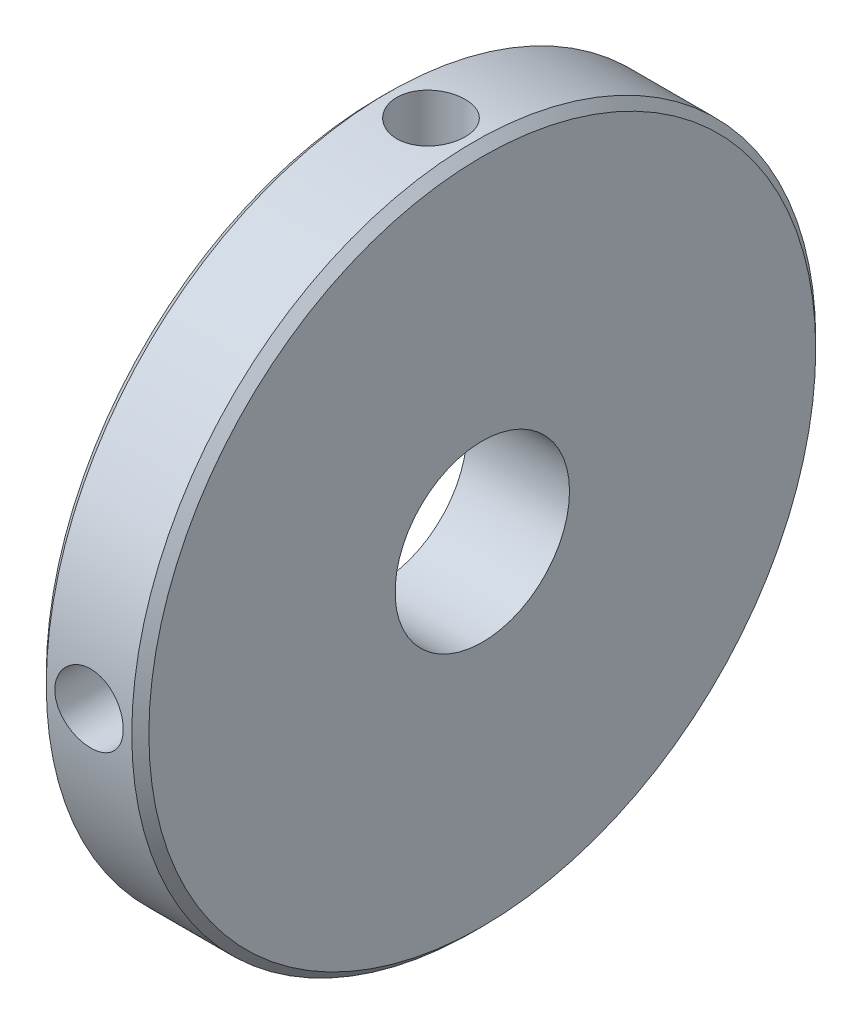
from build123d import *

# Parameters (mm, degrees)
ESQUISSE1_W                  = 6
ESQUISSE1_H                  = 20
CHANFREIN1_SIZE              = 0.5
R_P_TITION_CIRCULAIRE1_COUNT = 4
TROU_TARAUD_M12X1_752_D      = 10.2


with BuildPart() as part:
    # Esquisse1 → Base-R_volution (revolve)
    with BuildSketch(Plane.XY, mode=Mode.PRIVATE) as base_r_volution_sk:
        with Locations((3, 10)):
            Rectangle(ESQUISSE1_W, ESQUISSE1_H)
    revolve(base_r_volution_sk.sketch.rotate(Axis((-6.22145749, 0, 0), (1, 0, 0)), 90), axis=Axis((-6.22145749, 0, 0), (1, 0, 0)))

    # Chanfrein1
    chanfrein1_edges = [part.edges().sort_by_distance(p)[0] for p in [
        (6, 0, -20),
        (0, 0, -20),
    ]]
    chamfer(chanfrein1_edges, length=CHANFREIN1_SIZE)

    # Esquisse2 → Trou radial (revolve, cut)
    with BuildSketch(Plane.XY, mode=Mode.PRIVATE) as trou_radial_sk:
        Polygon((5, 20), (3, 20), (3, 13.798278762), (5, 15), align=None)
    trou_radial = revolve(trou_radial_sk.sketch.rotate(Axis((3, 20, 0), (0, -1, 0)), 180), axis=Axis((3, 20, 0), (0, -1, 0)), mode=Mode.SUBTRACT)

    # R_p_tition circulaire1: Trou radial ×4 about axis
    r_p_tition_circulaire1_axis = Axis((43.77854251, 0, 0), (-1, 0, 0))
    for i in range(1, R_P_TITION_CIRCULAIRE1_COUNT):
        add(trou_radial.rotate(r_p_tition_circulaire1_axis, i * 360 / R_P_TITION_CIRCULAIRE1_COUNT), mode=Mode.SUBTRACT)

    # Trou taraud_ M12x1.752 (through all)
    with Locations(Plane(origin=(6, 0, 0), x_dir=(0, 0, -1), z_dir=(1, 0, 0))):
        with Locations((0, 0)):
            Hole(TROU_TARAUD_M12X1_752_D / 2)


solid = part.part
